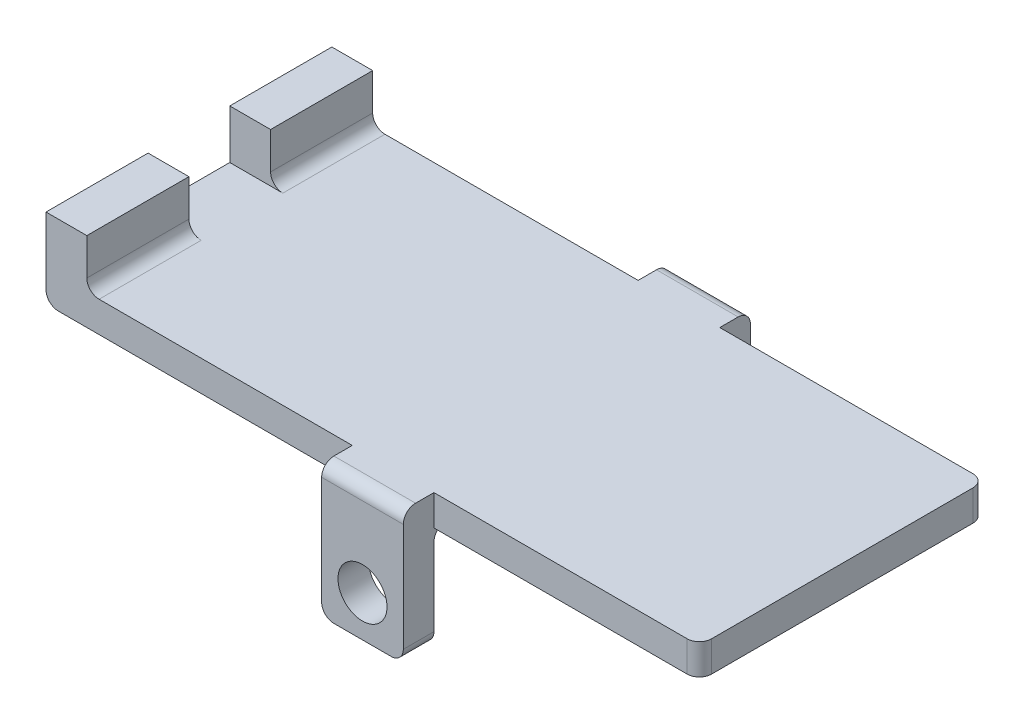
ISO-10303-21;
HEADER;
FILE_DESCRIPTION(('STEP AP214'),'2;1');
FILE_NAME('part.step','',(''),(''),'','','');
FILE_SCHEMA(('AUTOMOTIVE_DESIGN { 1 0 10303 214 1 1 1 1 }'));
ENDSEC;
DATA;
#1=APPLICATION_CONTEXT('core data for automotive mechanical design processes');
#2=APPLICATION_PROTOCOL_DEFINITION('international standard','automotive_design',2000,#1);
#3=PRODUCT_CONTEXT('',#1,'mechanical');
#4=PRODUCT('Part','Part','',(#3));
#5=PRODUCT_RELATED_PRODUCT_CATEGORY('part','',(#4));
#6=PRODUCT_DEFINITION_FORMATION('','',#4);
#7=PRODUCT_DEFINITION_CONTEXT('part definition',#1,'design');
#8=PRODUCT_DEFINITION('design','',#6,#7);
#9=PRODUCT_DEFINITION_SHAPE('','',#8);
#10=(LENGTH_UNIT() NAMED_UNIT(*) SI_UNIT(.MILLI.,.METRE.));
#11=(NAMED_UNIT(*) PLANE_ANGLE_UNIT() SI_UNIT($,.RADIAN.));
#12=(NAMED_UNIT(*) SI_UNIT($,.STERADIAN.) SOLID_ANGLE_UNIT());
#13=UNCERTAINTY_MEASURE_WITH_UNIT(LENGTH_MEASURE(1.E-05),#10,'distance_accuracy_value','');
#14=(GEOMETRIC_REPRESENTATION_CONTEXT(3) GLOBAL_UNCERTAINTY_ASSIGNED_CONTEXT((#13)) GLOBAL_UNIT_ASSIGNED_CONTEXT((#10,
#11,#12)) REPRESENTATION_CONTEXT('',''));
#15=CARTESIAN_POINT('',(0.,0.,0.));
#16=DIRECTION('',(0.,0.,1.));
#17=DIRECTION('',(1.,0.,0.));
#18=AXIS2_PLACEMENT_3D('',#15,#16,#17);
#19=CARTESIAN_POINT('',(-150.,12.,70.));
#20=DIRECTION('',(0.,-1.,0.));
#21=DIRECTION('',(1.,0.,0.));
#22=AXIS2_PLACEMENT_3D('',#19,#20,#21);
#23=PLANE('',#22);
#24=DIRECTION('',(0.,0.,-1.));
#25=VECTOR('',#24,1.);
#26=CARTESIAN_POINT('',(-160.,12.,70.));
#27=LINE('',#26,#25);
#28=CARTESIAN_POINT('',(-160.,12.,25.));
#29=VERTEX_POINT('',#28);
#30=CARTESIAN_POINT('',(-160.,12.,0.));
#31=VERTEX_POINT('',#30);
#32=EDGE_CURVE('E312',#29,#31,#27,.T.);
#33=ORIENTED_EDGE('',*,*,#32,.F.);
#34=DIRECTION('',(-1.,0.,0.));
#35=VECTOR('',#34,1.);
#36=CARTESIAN_POINT('',(-150.,12.,25.));
#37=LINE('',#36,#35);
#38=CARTESIAN_POINT('',(-150.,12.,25.));
#39=VERTEX_POINT('',#38);
#40=EDGE_CURVE('E288',#39,#29,#37,.T.);
#41=ORIENTED_EDGE('',*,*,#40,.F.);
#42=DIRECTION('',(0.,0.,-1.));
#43=VECTOR('',#42,1.);
#44=CARTESIAN_POINT('',(-150.,12.,70.));
#45=LINE('',#44,#43);
#46=CARTESIAN_POINT('',(-150.,12.,0.));
#47=VERTEX_POINT('',#46);
#48=EDGE_CURVE('E296',#39,#47,#45,.T.);
#49=ORIENTED_EDGE('',*,*,#48,.T.);
#50=DIRECTION('',(-1.,0.,0.));
#51=VECTOR('',#50,1.);
#52=CARTESIAN_POINT('',(-150.,12.,0.));
#53=LINE('',#52,#51);
#54=EDGE_CURVE('E526',#47,#31,#53,.T.);
#55=ORIENTED_EDGE('',*,*,#54,.T.);
#56=EDGE_LOOP('',(#33,#41,#49,#55));
#57=FACE_BOUND('',#56,.T.);
#58=ADVANCED_FACE('F39',(#57),#23,.F.);
#59=CARTESIAN_POINT('',(-150.,0.,70.));
#60=DIRECTION('',(-1.,0.,0.));
#61=DIRECTION('',(0.,0.,1.));
#62=AXIS2_PLACEMENT_3D('',#59,#60,#61);
#63=PLANE('',#62);
#64=DIRECTION('',(0.,-1.,0.));
#65=VECTOR('',#64,1.);
#66=CARTESIAN_POINT('',(-150.,12.,25.));
#67=LINE('',#66,#65);
#68=CARTESIAN_POINT('',(-150.,2.99999999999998,25.));
#69=VERTEX_POINT('',#68);
#70=EDGE_CURVE('E277',#39,#69,#67,.T.);
#71=ORIENTED_EDGE('',*,*,#70,.T.);
#72=DIRECTION('',(0.,0.,-1.));
#73=VECTOR('',#72,1.);
#74=CARTESIAN_POINT('',(-150.,2.99999999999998,0.));
#75=LINE('',#74,#73);
#76=CARTESIAN_POINT('',(-150.,2.99999999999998,0.));
#77=VERTEX_POINT('',#76);
#78=EDGE_CURVE('E476',#69,#77,#75,.T.);
#79=ORIENTED_EDGE('',*,*,#78,.T.);
#80=DIRECTION('',(0.,1.,0.));
#81=VECTOR('',#80,1.);
#82=CARTESIAN_POINT('',(-150.,0.,0.));
#83=LINE('',#82,#81);
#84=EDGE_CURVE('E306',#77,#47,#83,.T.);
#85=ORIENTED_EDGE('',*,*,#84,.T.);
#86=ORIENTED_EDGE('',*,*,#48,.F.);
#87=EDGE_LOOP('',(#71,#79,#85,#86));
#88=FACE_BOUND('',#87,.T.);
#89=ADVANCED_FACE('F565',(#88),#63,.F.);
#90=CARTESIAN_POINT('',(-160.,-7.5,70.));
#91=DIRECTION('',(0.,1.,0.));
#92=DIRECTION('',(0.,0.,1.));
#93=AXIS2_PLACEMENT_3D('',#90,#91,#92);
#94=PLANE('',#93);
#95=DIRECTION('',(1.,0.,0.));
#96=VECTOR('',#95,1.);
#97=CARTESIAN_POINT('',(-160.,-7.5,70.));
#98=LINE('',#97,#96);
#99=CARTESIAN_POINT('',(-65.,-7.5,70.));
#100=VERTEX_POINT('',#99);
#101=CARTESIAN_POINT('',(-3.,-7.5,70.));
#102=VERTEX_POINT('',#101);
#103=EDGE_CURVE('E520',#100,#102,#98,.T.);
#104=ORIENTED_EDGE('',*,*,#103,.F.);
#105=DIRECTION('',(0.,0.,-1.));
#106=VECTOR('',#105,1.);
#107=CARTESIAN_POINT('',(-65.,-7.5,77.5));
#108=LINE('',#107,#106);
#109=CARTESIAN_POINT('',(-65.,-7.5,67.));
#110=VERTEX_POINT('',#109);
#111=EDGE_CURVE('E437',#100,#110,#108,.T.);
#112=ORIENTED_EDGE('',*,*,#111,.T.);
#113=DIRECTION('',(1.,0.,0.));
#114=VECTOR('',#113,1.);
#115=CARTESIAN_POINT('',(-85.,-7.5,67.));
#116=LINE('',#115,#114);
#117=CARTESIAN_POINT('',(-85.,-7.5,67.));
#118=VERTEX_POINT('',#117);
#119=EDGE_CURVE('E433',#110,#118,#116,.F.);
#120=ORIENTED_EDGE('',*,*,#119,.T.);
#121=DIRECTION('',(0.,0.,1.));
#122=VECTOR('',#121,1.);
#123=CARTESIAN_POINT('',(-85.,-7.5,77.5));
#124=LINE('',#123,#122);
#125=CARTESIAN_POINT('',(-85.,-7.5,70.));
#126=VERTEX_POINT('',#125);
#127=EDGE_CURVE('E430',#118,#126,#124,.T.);
#128=ORIENTED_EDGE('',*,*,#127,.T.);
#129=CARTESIAN_POINT('',(-157.,-7.5,70.));
#130=VERTEX_POINT('',#129);
#131=EDGE_CURVE('E515',#130,#126,#98,.T.);
#132=ORIENTED_EDGE('',*,*,#131,.F.);
#133=DIRECTION('',(0.,0.,-1.));
#134=VECTOR('',#133,1.);
#135=CARTESIAN_POINT('',(-157.,-7.5,70.));
#136=LINE('',#135,#134);
#137=CARTESIAN_POINT('',(-157.,-7.5,0.));
#138=VERTEX_POINT('',#137);
#139=EDGE_CURVE('E323',#130,#138,#136,.T.);
#140=ORIENTED_EDGE('',*,*,#139,.T.);
#141=DIRECTION('',(1.,0.,0.));
#142=VECTOR('',#141,1.);
#143=CARTESIAN_POINT('',(-160.,-7.5,0.));
#144=LINE('',#143,#142);
#145=CARTESIAN_POINT('',(-85.,-7.5,0.));
#146=VERTEX_POINT('',#145);
#147=EDGE_CURVE('E536',#138,#146,#144,.T.);
#148=ORIENTED_EDGE('',*,*,#147,.T.);
#149=DIRECTION('',(0.,0.,1.));
#150=VECTOR('',#149,1.);
#151=CARTESIAN_POINT('',(-85.,-7.5,70.));
#152=LINE('',#151,#150);
#153=CARTESIAN_POINT('',(-85.,-7.5,3.));
#154=VERTEX_POINT('',#153);
#155=EDGE_CURVE('E419',#146,#154,#152,.T.);
#156=ORIENTED_EDGE('',*,*,#155,.T.);
#157=DIRECTION('',(1.,0.,0.));
#158=VECTOR('',#157,1.);
#159=CARTESIAN_POINT('',(-160.,-7.5,3.));
#160=LINE('',#159,#158);
#161=CARTESIAN_POINT('',(-65.,-7.5,3.));
#162=VERTEX_POINT('',#161);
#163=EDGE_CURVE('E423',#154,#162,#160,.T.);
#164=ORIENTED_EDGE('',*,*,#163,.T.);
#165=DIRECTION('',(0.,0.,-1.));
#166=VECTOR('',#165,1.);
#167=CARTESIAN_POINT('',(-65.,-7.5,70.));
#168=LINE('',#167,#166);
#169=CARTESIAN_POINT('',(-65.,-7.5,0.));
#170=VERTEX_POINT('',#169);
#171=EDGE_CURVE('E427',#162,#170,#168,.T.);
#172=ORIENTED_EDGE('',*,*,#171,.T.);
#173=CARTESIAN_POINT('',(-3.,-7.5,0.));
#174=VERTEX_POINT('',#173);
#175=EDGE_CURVE('E535',#170,#174,#144,.T.);
#176=ORIENTED_EDGE('',*,*,#175,.T.);
#177=CARTESIAN_POINT('',(-3.,-7.5,3.));
#178=DIRECTION('',(0.,1.,0.));
#179=DIRECTION('',(0.,0.,1.));
#180=AXIS2_PLACEMENT_3D('',#177,#178,#179);
#181=CIRCLE('',#180,3.);
#182=CARTESIAN_POINT('',(0.,-7.5,3.));
#183=VERTEX_POINT('',#182);
#184=EDGE_CURVE('E320',#174,#183,#181,.F.);
#185=ORIENTED_EDGE('',*,*,#184,.T.);
#186=DIRECTION('',(0.,0.,-1.));
#187=VECTOR('',#186,1.);
#188=CARTESIAN_POINT('',(0.,-7.5,70.));
#189=LINE('',#188,#187);
#190=CARTESIAN_POINT('',(0.,-7.5,67.));
#191=VERTEX_POINT('',#190);
#192=EDGE_CURVE('E301',#191,#183,#189,.T.);
#193=ORIENTED_EDGE('',*,*,#192,.F.);
#194=CARTESIAN_POINT('',(-3.,-7.5,67.));
#195=DIRECTION('',(0.,1.,0.));
#196=DIRECTION('',(0.,0.,1.));
#197=AXIS2_PLACEMENT_3D('',#194,#195,#196);
#198=CIRCLE('',#197,3.);
#199=EDGE_CURVE('E316',#191,#102,#198,.F.);
#200=ORIENTED_EDGE('',*,*,#199,.T.);
#201=EDGE_LOOP('',(#104,#112,#120,#128,#132,#140,#148,#156,#164,#172,#176,#185,#193,#200));
#202=FACE_BOUND('',#201,.T.);
#203=ADVANCED_FACE('F680',(#202),#94,.F.);
#204=CARTESIAN_POINT('',(0.,0.,0.));
#205=DIRECTION('',(0.,0.,1.));
#206=DIRECTION('',(1.,0.,0.));
#207=AXIS2_PLACEMENT_3D('',#204,#205,#206);
#208=PLANE('',#207);
#209=DIRECTION('',(-1.,0.,0.));
#210=VECTOR('',#209,1.);
#211=CARTESIAN_POINT('',(0.,0.,0.));
#212=LINE('',#211,#210);
#213=CARTESIAN_POINT('',(-85.,0.,0.));
#214=VERTEX_POINT('',#213);
#215=CARTESIAN_POINT('',(-147.,0.,0.));
#216=VERTEX_POINT('',#215);
#217=EDGE_CURVE('E539',#214,#216,#212,.T.);
#218=ORIENTED_EDGE('',*,*,#217,.F.);
#219=DIRECTION('',(0.,-1.,0.));
#220=VECTOR('',#219,1.);
#221=CARTESIAN_POINT('',(-85.,0.,0.));
#222=LINE('',#221,#220);
#223=EDGE_CURVE('E626',#214,#146,#222,.T.);
#224=ORIENTED_EDGE('',*,*,#223,.T.);
#225=ORIENTED_EDGE('',*,*,#147,.F.);
#226=CARTESIAN_POINT('',(-157.,-4.5,0.));
#227=DIRECTION('',(0.,0.,1.));
#228=DIRECTION('',(1.,0.,0.));
#229=AXIS2_PLACEMENT_3D('',#226,#227,#228);
#230=CIRCLE('',#229,3.);
#231=CARTESIAN_POINT('',(-160.,-4.5,0.));
#232=VERTEX_POINT('',#231);
#233=EDGE_CURVE('E331',#138,#232,#230,.F.);
#234=ORIENTED_EDGE('',*,*,#233,.T.);
#235=DIRECTION('',(0.,-1.,0.));
#236=VECTOR('',#235,1.);
#237=CARTESIAN_POINT('',(-160.,12.,0.));
#238=LINE('',#237,#236);
#239=EDGE_CURVE('E530',#31,#232,#238,.T.);
#240=ORIENTED_EDGE('',*,*,#239,.F.);
#241=ORIENTED_EDGE('',*,*,#54,.F.);
#242=ORIENTED_EDGE('',*,*,#84,.F.);
#243=CARTESIAN_POINT('',(-147.,2.99999999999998,0.));
#244=DIRECTION('',(0.,0.,1.));
#245=DIRECTION('',(1.,0.,0.));
#246=AXIS2_PLACEMENT_3D('',#243,#244,#245);
#247=CIRCLE('',#246,3.);
#248=EDGE_CURVE('E495',#77,#216,#247,.T.);
#249=ORIENTED_EDGE('',*,*,#248,.T.);
#250=EDGE_LOOP('',(#218,#224,#225,#234,#240,#241,#242,#249));
#251=FACE_BOUND('',#250,.T.);
#252=ADVANCED_FACE('F729',(#251),#208,.F.);
#253=CARTESIAN_POINT('',(0.,0.,70.));
#254=DIRECTION('',(0.,0.,1.));
#255=DIRECTION('',(1.,0.,0.));
#256=AXIS2_PLACEMENT_3D('',#253,#254,#255);
#257=PLANE('',#256);
#258=ORIENTED_EDGE('',*,*,#131,.T.);
#259=DIRECTION('',(0.,-1.,0.));
#260=VECTOR('',#259,1.);
#261=CARTESIAN_POINT('',(-85.,0.,70.));
#262=LINE('',#261,#260);
#263=CARTESIAN_POINT('',(-85.,0.,70.));
#264=VERTEX_POINT('',#263);
#265=EDGE_CURVE('E512',#264,#126,#262,.T.);
#266=ORIENTED_EDGE('',*,*,#265,.F.);
#267=DIRECTION('',(-1.,0.,0.));
#268=VECTOR('',#267,1.);
#269=CARTESIAN_POINT('',(0.,0.,70.));
#270=LINE('',#269,#268);
#271=CARTESIAN_POINT('',(-147.,0.,70.));
#272=VERTEX_POINT('',#271);
#273=EDGE_CURVE('E507',#264,#272,#270,.T.);
#274=ORIENTED_EDGE('',*,*,#273,.T.);
#275=CARTESIAN_POINT('',(-147.,2.99999999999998,70.));
#276=DIRECTION('',(0.,0.,1.));
#277=DIRECTION('',(1.,0.,0.));
#278=AXIS2_PLACEMENT_3D('',#275,#276,#277);
#279=CIRCLE('',#278,3.);
#280=CARTESIAN_POINT('',(-150.,2.99999999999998,70.));
#281=VERTEX_POINT('',#280);
#282=EDGE_CURVE('E11',#272,#281,#279,.F.);
#283=ORIENTED_EDGE('',*,*,#282,.T.);
#284=DIRECTION('',(0.,1.,0.));
#285=VECTOR('',#284,1.);
#286=CARTESIAN_POINT('',(-150.,0.,70.));
#287=LINE('',#286,#285);
#288=CARTESIAN_POINT('',(-150.,12.,70.));
#289=VERTEX_POINT('',#288);
#290=EDGE_CURVE('E304',#281,#289,#287,.T.);
#291=ORIENTED_EDGE('',*,*,#290,.T.);
#292=DIRECTION('',(-1.,0.,0.));
#293=VECTOR('',#292,1.);
#294=CARTESIAN_POINT('',(-150.,12.,70.));
#295=LINE('',#294,#293);
#296=CARTESIAN_POINT('',(-160.,12.,70.));
#297=VERTEX_POINT('',#296);
#298=EDGE_CURVE('E293',#289,#297,#295,.T.);
#299=ORIENTED_EDGE('',*,*,#298,.T.);
#300=DIRECTION('',(0.,-1.,0.));
#301=VECTOR('',#300,1.);
#302=CARTESIAN_POINT('',(-160.,12.,70.));
#303=LINE('',#302,#301);
#304=CARTESIAN_POINT('',(-160.,-4.5,70.));
#305=VERTEX_POINT('',#304);
#306=EDGE_CURVE('E666',#297,#305,#303,.T.);
#307=ORIENTED_EDGE('',*,*,#306,.T.);
#308=CARTESIAN_POINT('',(-157.,-4.5,70.));
#309=DIRECTION('',(0.,0.,1.));
#310=DIRECTION('',(1.,0.,0.));
#311=AXIS2_PLACEMENT_3D('',#308,#309,#310);
#312=CIRCLE('',#311,3.);
#313=EDGE_CURVE('E341',#305,#130,#312,.T.);
#314=ORIENTED_EDGE('',*,*,#313,.T.);
#315=EDGE_LOOP('',(#258,#266,#274,#283,#291,#299,#307,#314));
#316=FACE_BOUND('',#315,.T.);
#317=ADVANCED_FACE('F510',(#316),#257,.T.);
#318=CARTESIAN_POINT('',(-3.,0.,70.));
#319=VERTEX_POINT('',#318);
#320=CARTESIAN_POINT('',(-65.,0.,70.));
#321=VERTEX_POINT('',#320);
#322=EDGE_CURVE('E514',#319,#321,#270,.T.);
#323=ORIENTED_EDGE('',*,*,#322,.T.);
#324=DIRECTION('',(0.,1.,0.));
#325=VECTOR('',#324,1.);
#326=CARTESIAN_POINT('',(-65.,0.,70.));
#327=LINE('',#326,#325);
#328=EDGE_CURVE('E651',#100,#321,#327,.T.);
#329=ORIENTED_EDGE('',*,*,#328,.F.);
#330=ORIENTED_EDGE('',*,*,#103,.T.);
#331=DIRECTION('',(0.,1.,0.));
#332=VECTOR('',#331,1.);
#333=CARTESIAN_POINT('',(-3.,0.,70.));
#334=LINE('',#333,#332);
#335=EDGE_CURVE('E337',#102,#319,#334,.T.);
#336=ORIENTED_EDGE('',*,*,#335,.T.);
#337=EDGE_LOOP('',(#323,#329,#330,#336));
#338=FACE_BOUND('',#337,.T.);
#339=ADVANCED_FACE('F674',(#338),#257,.T.);
#340=CARTESIAN_POINT('',(-150.,12.,45.));
#341=VERTEX_POINT('',#340);
#342=EDGE_CURVE('E271',#289,#341,#45,.T.);
#343=ORIENTED_EDGE('',*,*,#342,.T.);
#344=DIRECTION('',(-1.,0.,0.));
#345=VECTOR('',#344,1.);
#346=CARTESIAN_POINT('',(-150.,12.,45.));
#347=LINE('',#346,#345);
#348=CARTESIAN_POINT('',(-160.,12.,45.));
#349=VERTEX_POINT('',#348);
#350=EDGE_CURVE('E280',#341,#349,#347,.T.);
#351=ORIENTED_EDGE('',*,*,#350,.T.);
#352=EDGE_CURVE('E313',#297,#349,#27,.T.);
#353=ORIENTED_EDGE('',*,*,#352,.F.);
#354=ORIENTED_EDGE('',*,*,#298,.F.);
#355=EDGE_LOOP('',(#343,#351,#353,#354));
#356=FACE_BOUND('',#355,.T.);
#357=ADVANCED_FACE('F291',(#356),#23,.F.);
#358=CARTESIAN_POINT('',(-160.,12.,70.));
#359=DIRECTION('',(1.,0.,0.));
#360=DIRECTION('',(0.,0.,-1.));
#361=AXIS2_PLACEMENT_3D('',#358,#359,#360);
#362=PLANE('',#361);
#363=DIRECTION('',(0.,0.,1.));
#364=VECTOR('',#363,1.);
#365=CARTESIAN_POINT('',(-160.,0.,25.));
#366=LINE('',#365,#364);
#367=CARTESIAN_POINT('',(-160.,0.,25.));
#368=VERTEX_POINT('',#367);
#369=CARTESIAN_POINT('',(-160.,0.,45.));
#370=VERTEX_POINT('',#369);
#371=EDGE_CURVE('E570',#368,#370,#366,.T.);
#372=ORIENTED_EDGE('',*,*,#371,.F.);
#373=DIRECTION('',(0.,-1.,0.));
#374=VECTOR('',#373,1.);
#375=CARTESIAN_POINT('',(-160.,12.,25.));
#376=LINE('',#375,#374);
#377=EDGE_CURVE('E573',#29,#368,#376,.T.);
#378=ORIENTED_EDGE('',*,*,#377,.F.);
#379=ORIENTED_EDGE('',*,*,#32,.T.);
#380=ORIENTED_EDGE('',*,*,#239,.T.);
#381=DIRECTION('',(0.,0.,-1.));
#382=VECTOR('',#381,1.);
#383=CARTESIAN_POINT('',(-160.,-4.5,70.));
#384=LINE('',#383,#382);
#385=EDGE_CURVE('E334',#232,#305,#384,.F.);
#386=ORIENTED_EDGE('',*,*,#385,.T.);
#387=ORIENTED_EDGE('',*,*,#306,.F.);
#388=ORIENTED_EDGE('',*,*,#352,.T.);
#389=DIRECTION('',(0.,1.,0.));
#390=VECTOR('',#389,1.);
#391=CARTESIAN_POINT('',(-160.,12.,45.));
#392=LINE('',#391,#390);
#393=EDGE_CURVE('E283',#370,#349,#392,.T.);
#394=ORIENTED_EDGE('',*,*,#393,.F.);
#395=EDGE_LOOP('',(#372,#378,#379,#380,#386,#387,#388,#394));
#396=FACE_BOUND('',#395,.T.);
#397=ADVANCED_FACE('F751',(#396),#362,.F.);
#398=CARTESIAN_POINT('',(0.,-7.5,70.));
#399=DIRECTION('',(-1.,0.,0.));
#400=DIRECTION('',(0.,0.,1.));
#401=AXIS2_PLACEMENT_3D('',#398,#399,#400);
#402=PLANE('',#401);
#403=ORIENTED_EDGE('',*,*,#192,.T.);
#404=DIRECTION('',(0.,1.,0.));
#405=VECTOR('',#404,1.);
#406=CARTESIAN_POINT('',(0.,-7.5,3.));
#407=LINE('',#406,#405);
#408=CARTESIAN_POINT('',(0.,0.,3.));
#409=VERTEX_POINT('',#408);
#410=EDGE_CURVE('E347',#183,#409,#407,.T.);
#411=ORIENTED_EDGE('',*,*,#410,.T.);
#412=DIRECTION('',(0.,0.,-1.));
#413=VECTOR('',#412,1.);
#414=CARTESIAN_POINT('',(0.,0.,70.));
#415=LINE('',#414,#413);
#416=CARTESIAN_POINT('',(0.,0.,67.));
#417=VERTEX_POINT('',#416);
#418=EDGE_CURVE('E295',#417,#409,#415,.T.);
#419=ORIENTED_EDGE('',*,*,#418,.F.);
#420=DIRECTION('',(0.,1.,0.));
#421=VECTOR('',#420,1.);
#422=CARTESIAN_POINT('',(0.,-7.5,67.));
#423=LINE('',#422,#421);
#424=EDGE_CURVE('E344',#417,#191,#423,.F.);
#425=ORIENTED_EDGE('',*,*,#424,.T.);
#426=EDGE_LOOP('',(#403,#411,#419,#425));
#427=FACE_BOUND('',#426,.T.);
#428=ADVANCED_FACE('F686',(#427),#402,.F.);
#429=CARTESIAN_POINT('',(0.,0.,70.));
#430=DIRECTION('',(0.,-1.,0.));
#431=DIRECTION('',(1.,0.,0.));
#432=AXIS2_PLACEMENT_3D('',#429,#430,#431);
#433=PLANE('',#432);
#434=ORIENTED_EDGE('',*,*,#217,.T.);
#435=DIRECTION('',(0.,0.,-1.));
#436=VECTOR('',#435,1.);
#437=CARTESIAN_POINT('',(-147.,0.,25.));
#438=LINE('',#437,#436);
#439=CARTESIAN_POINT('',(-147.,0.,25.));
#440=VERTEX_POINT('',#439);
#441=EDGE_CURVE('E489',#216,#440,#438,.F.);
#442=ORIENTED_EDGE('',*,*,#441,.T.);
#443=DIRECTION('',(-1.,0.,0.));
#444=VECTOR('',#443,1.);
#445=CARTESIAN_POINT('',(-150.,0.,25.));
#446=LINE('',#445,#444);
#447=EDGE_CURVE('E276',#440,#368,#446,.T.);
#448=ORIENTED_EDGE('',*,*,#447,.T.);
#449=ORIENTED_EDGE('',*,*,#371,.T.);
#450=DIRECTION('',(-1.,0.,0.));
#451=VECTOR('',#450,1.);
#452=CARTESIAN_POINT('',(-150.,0.,45.));
#453=LINE('',#452,#451);
#454=CARTESIAN_POINT('',(-147.,0.,45.));
#455=VERTEX_POINT('',#454);
#456=EDGE_CURVE('E289',#455,#370,#453,.T.);
#457=ORIENTED_EDGE('',*,*,#456,.F.);
#458=DIRECTION('',(0.,0.,-1.));
#459=VECTOR('',#458,1.);
#460=CARTESIAN_POINT('',(-147.,0.,70.));
#461=LINE('',#460,#459);
#462=EDGE_CURVE('E486',#455,#272,#461,.F.);
#463=ORIENTED_EDGE('',*,*,#462,.T.);
#464=ORIENTED_EDGE('',*,*,#273,.F.);
#465=DIRECTION('',(0.,0.,-1.));
#466=VECTOR('',#465,1.);
#467=CARTESIAN_POINT('',(-85.,0.,77.5));
#468=LINE('',#467,#466);
#469=CARTESIAN_POINT('',(-85.,0.,74.5));
#470=VERTEX_POINT('',#469);
#471=EDGE_CURVE('E655',#470,#264,#468,.T.);
#472=ORIENTED_EDGE('',*,*,#471,.F.);
#473=DIRECTION('',(-1.,0.,0.));
#474=VECTOR('',#473,1.);
#475=CARTESIAN_POINT('',(-65.,0.,74.5));
#476=LINE('',#475,#474);
#477=CARTESIAN_POINT('',(-65.,0.,74.5));
#478=VERTEX_POINT('',#477);
#479=EDGE_CURVE('E377',#470,#478,#476,.F.);
#480=ORIENTED_EDGE('',*,*,#479,.T.);
#481=DIRECTION('',(0.,0.,-1.));
#482=VECTOR('',#481,1.);
#483=CARTESIAN_POINT('',(-65.,0.,77.5));
#484=LINE('',#483,#482);
#485=EDGE_CURVE('E531',#478,#321,#484,.T.);
#486=ORIENTED_EDGE('',*,*,#485,.T.);
#487=ORIENTED_EDGE('',*,*,#322,.F.);
#488=CARTESIAN_POINT('',(-3.,0.,67.));
#489=DIRECTION('',(0.,-1.,0.));
#490=DIRECTION('',(1.,0.,0.));
#491=AXIS2_PLACEMENT_3D('',#488,#489,#490);
#492=CIRCLE('',#491,3.);
#493=EDGE_CURVE('E351',#319,#417,#492,.F.);
#494=ORIENTED_EDGE('',*,*,#493,.T.);
#495=ORIENTED_EDGE('',*,*,#418,.T.);
#496=CARTESIAN_POINT('',(-3.,0.,3.));
#497=DIRECTION('',(0.,-1.,0.));
#498=DIRECTION('',(1.,0.,0.));
#499=AXIS2_PLACEMENT_3D('',#496,#497,#498);
#500=CIRCLE('',#499,3.);
#501=CARTESIAN_POINT('',(-3.,0.,0.));
#502=VERTEX_POINT('',#501);
#503=EDGE_CURVE('E354',#409,#502,#500,.F.);
#504=ORIENTED_EDGE('',*,*,#503,.T.);
#505=CARTESIAN_POINT('',(-65.,0.,0.));
#506=VERTEX_POINT('',#505);
#507=EDGE_CURVE('E540',#502,#506,#212,.T.);
#508=ORIENTED_EDGE('',*,*,#507,.T.);
#509=DIRECTION('',(0.,0.,1.));
#510=VECTOR('',#509,1.);
#511=CARTESIAN_POINT('',(-65.,0.,-7.5));
#512=LINE('',#511,#510);
#513=CARTESIAN_POINT('',(-65.,0.,-4.5));
#514=VERTEX_POINT('',#513);
#515=EDGE_CURVE('E636',#514,#506,#512,.T.);
#516=ORIENTED_EDGE('',*,*,#515,.F.);
#517=DIRECTION('',(-1.,0.,0.));
#518=VECTOR('',#517,1.);
#519=CARTESIAN_POINT('',(-85.,0.,-4.5));
#520=LINE('',#519,#518);
#521=CARTESIAN_POINT('',(-85.,0.,-4.5));
#522=VERTEX_POINT('',#521);
#523=EDGE_CURVE('E373',#514,#522,#520,.T.);
#524=ORIENTED_EDGE('',*,*,#523,.T.);
#525=DIRECTION('',(0.,0.,1.));
#526=VECTOR('',#525,1.);
#527=CARTESIAN_POINT('',(-85.,0.,-7.5));
#528=LINE('',#527,#526);
#529=EDGE_CURVE('E551',#522,#214,#528,.T.);
#530=ORIENTED_EDGE('',*,*,#529,.T.);
#531=EDGE_LOOP('',(#434,#442,#448,#449,#457,#463,#464,#472,#480,#486,#487,#494,#495,#504,#508,
#516,#524,#530));
#532=FACE_BOUND('',#531,.T.);
#533=ADVANCED_FACE('F505',(#532),#433,.F.);
#534=ORIENTED_EDGE('',*,*,#290,.F.);
#535=DIRECTION('',(0.,0.,-1.));
#536=VECTOR('',#535,1.);
#537=CARTESIAN_POINT('',(-150.,2.99999999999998,45.));
#538=LINE('',#537,#536);
#539=CARTESIAN_POINT('',(-150.,2.99999999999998,45.));
#540=VERTEX_POINT('',#539);
#541=EDGE_CURVE('E273',#281,#540,#538,.T.);
#542=ORIENTED_EDGE('',*,*,#541,.T.);
#543=DIRECTION('',(0.,1.,0.));
#544=VECTOR('',#543,1.);
#545=CARTESIAN_POINT('',(-150.,12.,45.));
#546=LINE('',#545,#544);
#547=EDGE_CURVE('E267',#540,#341,#546,.T.);
#548=ORIENTED_EDGE('',*,*,#547,.T.);
#549=ORIENTED_EDGE('',*,*,#342,.F.);
#550=EDGE_LOOP('',(#534,#542,#548,#549));
#551=FACE_BOUND('',#550,.T.);
#552=ADVANCED_FACE('F269',(#551),#63,.F.);
#553=ORIENTED_EDGE('',*,*,#175,.F.);
#554=DIRECTION('',(0.,1.,0.));
#555=VECTOR('',#554,1.);
#556=CARTESIAN_POINT('',(-65.,0.,0.));
#557=LINE('',#556,#555);
#558=EDGE_CURVE('E632',#170,#506,#557,.T.);
#559=ORIENTED_EDGE('',*,*,#558,.T.);
#560=ORIENTED_EDGE('',*,*,#507,.F.);
#561=DIRECTION('',(0.,1.,0.));
#562=VECTOR('',#561,1.);
#563=CARTESIAN_POINT('',(-3.,0.,0.));
#564=LINE('',#563,#562);
#565=EDGE_CURVE('E327',#502,#174,#564,.F.);
#566=ORIENTED_EDGE('',*,*,#565,.T.);
#567=EDGE_LOOP('',(#553,#559,#560,#566));
#568=FACE_BOUND('',#567,.T.);
#569=ADVANCED_FACE('F694',(#568),#208,.F.);
#570=CARTESIAN_POINT('',(-157.,-4.5,70.));
#571=DIRECTION('',(0.,0.,-1.));
#572=DIRECTION('',(-1.,0.,0.));
#573=AXIS2_PLACEMENT_3D('',#570,#571,#572);
#574=CYLINDRICAL_SURFACE('',#573,3.);
#575=ORIENTED_EDGE('',*,*,#313,.F.);
#576=ORIENTED_EDGE('',*,*,#385,.F.);
#577=ORIENTED_EDGE('',*,*,#233,.F.);
#578=ORIENTED_EDGE('',*,*,#139,.F.);
#579=EDGE_LOOP('',(#575,#576,#577,#578));
#580=FACE_BOUND('',#579,.T.);
#581=ADVANCED_FACE('F740',(#580),#574,.T.);
#582=CARTESIAN_POINT('',(-3.,-7.5,3.));
#583=DIRECTION('',(0.,1.,0.));
#584=DIRECTION('',(0.,0.,1.));
#585=AXIS2_PLACEMENT_3D('',#582,#583,#584);
#586=CYLINDRICAL_SURFACE('',#585,3.);
#587=ORIENTED_EDGE('',*,*,#184,.F.);
#588=ORIENTED_EDGE('',*,*,#565,.F.);
#589=ORIENTED_EDGE('',*,*,#503,.F.);
#590=ORIENTED_EDGE('',*,*,#410,.F.);
#591=EDGE_LOOP('',(#587,#588,#589,#590));
#592=FACE_BOUND('',#591,.T.);
#593=ADVANCED_FACE('F690',(#592),#586,.T.);
#594=CARTESIAN_POINT('',(-3.,0.,67.));
#595=DIRECTION('',(0.,-1.,0.));
#596=DIRECTION('',(0.,0.,-1.));
#597=AXIS2_PLACEMENT_3D('',#594,#595,#596);
#598=CYLINDRICAL_SURFACE('',#597,3.);
#599=ORIENTED_EDGE('',*,*,#199,.F.);
#600=ORIENTED_EDGE('',*,*,#424,.F.);
#601=ORIENTED_EDGE('',*,*,#493,.F.);
#602=ORIENTED_EDGE('',*,*,#335,.F.);
#603=EDGE_LOOP('',(#599,#600,#601,#602));
#604=FACE_BOUND('',#603,.T.);
#605=ADVANCED_FACE('F683',(#604),#598,.T.);
#606=CARTESIAN_POINT('',(-85.,0.,77.5));
#607=DIRECTION('',(1.,0.,0.));
#608=DIRECTION('',(0.,0.,-1.));
#609=AXIS2_PLACEMENT_3D('',#606,#607,#608);
#610=PLANE('',#609);
#611=DIRECTION('',(0.,-1.,0.));
#612=VECTOR('',#611,1.);
#613=CARTESIAN_POINT('',(-85.,0.,77.5));
#614=LINE('',#613,#612);
#615=CARTESIAN_POINT('',(-85.,-3.00000000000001,77.5));
#616=VERTEX_POINT('',#615);
#617=CARTESIAN_POINT('',(-85.,-29.5,77.5));
#618=VERTEX_POINT('',#617);
#619=EDGE_CURVE('E646',#616,#618,#614,.T.);
#620=ORIENTED_EDGE('',*,*,#619,.F.);
#621=CARTESIAN_POINT('',(-85.,-3.00000000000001,74.5));
#622=DIRECTION('',(1.,0.,0.));
#623=DIRECTION('',(0.,0.,-1.));
#624=AXIS2_PLACEMENT_3D('',#621,#622,#623);
#625=CIRCLE('',#624,3.);
#626=EDGE_CURVE('E370',#616,#470,#625,.F.);
#627=ORIENTED_EDGE('',*,*,#626,.T.);
#628=ORIENTED_EDGE('',*,*,#471,.T.);
#629=ORIENTED_EDGE('',*,*,#265,.T.);
#630=ORIENTED_EDGE('',*,*,#127,.F.);
#631=CARTESIAN_POINT('',(-85.,-10.5,67.));
#632=DIRECTION('',(1.,0.,0.));
#633=DIRECTION('',(0.,0.,-1.));
#634=AXIS2_PLACEMENT_3D('',#631,#632,#633);
#635=CIRCLE('',#634,3.);
#636=CARTESIAN_POINT('',(-85.,-10.5,70.));
#637=VERTEX_POINT('',#636);
#638=EDGE_CURVE('E467',#118,#637,#635,.T.);
#639=ORIENTED_EDGE('',*,*,#638,.T.);
#640=DIRECTION('',(0.,1.,0.));
#641=VECTOR('',#640,1.);
#642=CARTESIAN_POINT('',(-85.,-32.5,70.));
#643=LINE('',#642,#641);
#644=CARTESIAN_POINT('',(-85.,-29.5,70.));
#645=VERTEX_POINT('',#644);
#646=EDGE_CURVE('E622',#645,#637,#643,.T.);
#647=ORIENTED_EDGE('',*,*,#646,.F.);
#648=DIRECTION('',(0.,0.,-1.));
#649=VECTOR('',#648,1.);
#650=CARTESIAN_POINT('',(-85.,-29.5,77.5));
#651=LINE('',#650,#649);
#652=EDGE_CURVE('E367',#645,#618,#651,.F.);
#653=ORIENTED_EDGE('',*,*,#652,.T.);
#654=EDGE_LOOP('',(#620,#627,#628,#629,#630,#639,#647,#653));
#655=FACE_BOUND('',#654,.T.);
#656=ADVANCED_FACE('F760',(#655),#610,.F.);
#657=CARTESIAN_POINT('',(-65.,0.,77.5));
#658=DIRECTION('',(-1.,0.,0.));
#659=DIRECTION('',(0.,0.,1.));
#660=AXIS2_PLACEMENT_3D('',#657,#658,#659);
#661=PLANE('',#660);
#662=ORIENTED_EDGE('',*,*,#485,.F.);
#663=CARTESIAN_POINT('',(-65.,-3.00000000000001,74.5));
#664=DIRECTION('',(-1.,0.,0.));
#665=DIRECTION('',(0.,0.,1.));
#666=AXIS2_PLACEMENT_3D('',#663,#664,#665);
#667=CIRCLE('',#666,3.);
#668=CARTESIAN_POINT('',(-65.,-3.00000000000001,77.5));
#669=VERTEX_POINT('',#668);
#670=EDGE_CURVE('E383',#478,#669,#667,.F.);
#671=ORIENTED_EDGE('',*,*,#670,.T.);
#672=DIRECTION('',(0.,1.,0.));
#673=VECTOR('',#672,1.);
#674=CARTESIAN_POINT('',(-65.,0.,77.5));
#675=LINE('',#674,#673);
#676=CARTESIAN_POINT('',(-65.,-29.5,77.5));
#677=VERTEX_POINT('',#676);
#678=EDGE_CURVE('E650',#677,#669,#675,.T.);
#679=ORIENTED_EDGE('',*,*,#678,.F.);
#680=DIRECTION('',(0.,0.,1.));
#681=VECTOR('',#680,1.);
#682=CARTESIAN_POINT('',(-65.,-29.5,70.));
#683=LINE('',#682,#681);
#684=CARTESIAN_POINT('',(-65.,-29.5,70.));
#685=VERTEX_POINT('',#684);
#686=EDGE_CURVE('E380',#677,#685,#683,.F.);
#687=ORIENTED_EDGE('',*,*,#686,.T.);
#688=DIRECTION('',(0.,1.,0.));
#689=VECTOR('',#688,1.);
#690=CARTESIAN_POINT('',(-65.,-32.5,70.));
#691=LINE('',#690,#689);
#692=CARTESIAN_POINT('',(-65.,-10.5,70.));
#693=VERTEX_POINT('',#692);
#694=EDGE_CURVE('E618',#685,#693,#691,.T.);
#695=ORIENTED_EDGE('',*,*,#694,.T.);
#696=CARTESIAN_POINT('',(-65.,-10.5,67.));
#697=DIRECTION('',(-1.,0.,0.));
#698=DIRECTION('',(0.,0.,1.));
#699=AXIS2_PLACEMENT_3D('',#696,#697,#698);
#700=CIRCLE('',#699,3.);
#701=EDGE_CURVE('E464',#693,#110,#700,.T.);
#702=ORIENTED_EDGE('',*,*,#701,.T.);
#703=ORIENTED_EDGE('',*,*,#111,.F.);
#704=ORIENTED_EDGE('',*,*,#328,.T.);
#705=EDGE_LOOP('',(#662,#671,#679,#687,#695,#702,#703,#704));
#706=FACE_BOUND('',#705,.T.);
#707=ADVANCED_FACE('F763',(#706),#661,.F.);
#708=CARTESIAN_POINT('',(0.,0.,77.5));
#709=DIRECTION('',(0.,0.,1.));
#710=DIRECTION('',(1.,0.,0.));
#711=AXIS2_PLACEMENT_3D('',#708,#709,#710);
#712=PLANE('',#711);
#713=CARTESIAN_POINT('',(-75.,-22.5,77.5));
#714=DIRECTION('',(0.,0.,1.));
#715=DIRECTION('',(1.,0.,0.));
#716=AXIS2_PLACEMENT_3D('',#713,#714,#715);
#717=CIRCLE('',#716,6.);
#718=CARTESIAN_POINT('',(-69.,-22.5,77.5));
#719=VERTEX_POINT('',#718);
#720=EDGE_CURVE('E579',#719,#719,#717,.T.);
#721=ORIENTED_EDGE('',*,*,#720,.F.);
#722=EDGE_LOOP('',(#721));
#723=FACE_BOUND('',#722,.T.);
#724=ORIENTED_EDGE('',*,*,#678,.T.);
#725=DIRECTION('',(-1.,0.,0.));
#726=VECTOR('',#725,1.);
#727=CARTESIAN_POINT('',(-85.,-3.00000000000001,77.5));
#728=LINE('',#727,#726);
#729=EDGE_CURVE('E363',#669,#616,#728,.T.);
#730=ORIENTED_EDGE('',*,*,#729,.T.);
#731=ORIENTED_EDGE('',*,*,#619,.T.);
#732=CARTESIAN_POINT('',(-82.,-29.5,77.5));
#733=DIRECTION('',(0.,0.,1.));
#734=DIRECTION('',(1.,0.,0.));
#735=AXIS2_PLACEMENT_3D('',#732,#733,#734);
#736=CIRCLE('',#735,3.);
#737=CARTESIAN_POINT('',(-82.,-32.5,77.5));
#738=VERTEX_POINT('',#737);
#739=EDGE_CURVE('E360',#618,#738,#736,.T.);
#740=ORIENTED_EDGE('',*,*,#739,.T.);
#741=DIRECTION('',(-1.,0.,0.));
#742=VECTOR('',#741,1.);
#743=CARTESIAN_POINT('',(-85.,-32.5,77.5));
#744=LINE('',#743,#742);
#745=CARTESIAN_POINT('',(-68.,-32.5,77.5));
#746=VERTEX_POINT('',#745);
#747=EDGE_CURVE('E614',#746,#738,#744,.T.);
#748=ORIENTED_EDGE('',*,*,#747,.F.);
#749=CARTESIAN_POINT('',(-68.,-29.5,77.5));
#750=DIRECTION('',(0.,0.,1.));
#751=DIRECTION('',(1.,0.,0.));
#752=AXIS2_PLACEMENT_3D('',#749,#750,#751);
#753=CIRCLE('',#752,3.);
#754=EDGE_CURVE('E357',#746,#677,#753,.T.);
#755=ORIENTED_EDGE('',*,*,#754,.T.);
#756=EDGE_LOOP('',(#724,#730,#731,#740,#748,#755));
#757=FACE_BOUND('',#756,.T.);
#758=ADVANCED_FACE('F767',(#723,#757),#712,.T.);
#759=CARTESIAN_POINT('',(-85.,0.,-7.5));
#760=DIRECTION('',(-1.,0.,0.));
#761=DIRECTION('',(0.,0.,1.));
#762=AXIS2_PLACEMENT_3D('',#759,#760,#761);
#763=PLANE('',#762);
#764=ORIENTED_EDGE('',*,*,#529,.F.);
#765=CARTESIAN_POINT('',(-85.,-3.00000000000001,-4.5));
#766=DIRECTION('',(-1.,0.,0.));
#767=DIRECTION('',(0.,0.,1.));
#768=AXIS2_PLACEMENT_3D('',#765,#766,#767);
#769=CIRCLE('',#768,3.);
#770=CARTESIAN_POINT('',(-85.,-3.00000000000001,-7.5));
#771=VERTEX_POINT('',#770);
#772=EDGE_CURVE('E390',#522,#771,#769,.T.);
#773=ORIENTED_EDGE('',*,*,#772,.T.);
#774=DIRECTION('',(0.,-1.,0.));
#775=VECTOR('',#774,1.);
#776=CARTESIAN_POINT('',(-85.,0.,-7.5));
#777=LINE('',#776,#775);
#778=CARTESIAN_POINT('',(-85.,-29.5,-7.5));
#779=VERTEX_POINT('',#778);
#780=EDGE_CURVE('E627',#771,#779,#777,.T.);
#781=ORIENTED_EDGE('',*,*,#780,.T.);
#782=DIRECTION('',(0.,0.,1.));
#783=VECTOR('',#782,1.);
#784=CARTESIAN_POINT('',(-85.,-29.5,-7.5));
#785=LINE('',#784,#783);
#786=CARTESIAN_POINT('',(-85.,-29.5,0.));
#787=VERTEX_POINT('',#786);
#788=EDGE_CURVE('E386',#779,#787,#785,.T.);
#789=ORIENTED_EDGE('',*,*,#788,.T.);
#790=DIRECTION('',(0.,1.,0.));
#791=VECTOR('',#790,1.);
#792=CARTESIAN_POINT('',(-85.,-32.5,0.));
#793=LINE('',#792,#791);
#794=CARTESIAN_POINT('',(-85.,-10.5,0.));
#795=VERTEX_POINT('',#794);
#796=EDGE_CURVE('E602',#787,#795,#793,.T.);
#797=ORIENTED_EDGE('',*,*,#796,.T.);
#798=CARTESIAN_POINT('',(-85.,-10.5,3.));
#799=DIRECTION('',(-1.,0.,0.));
#800=DIRECTION('',(0.,0.,1.));
#801=AXIS2_PLACEMENT_3D('',#798,#799,#800);
#802=CIRCLE('',#801,3.);
#803=EDGE_CURVE('E473',#795,#154,#802,.F.);
#804=ORIENTED_EDGE('',*,*,#803,.T.);
#805=ORIENTED_EDGE('',*,*,#155,.F.);
#806=ORIENTED_EDGE('',*,*,#223,.F.);
#807=EDGE_LOOP('',(#764,#773,#781,#789,#797,#804,#805,#806));
#808=FACE_BOUND('',#807,.T.);
#809=ADVANCED_FACE('F706',(#808),#763,.T.);
#810=CARTESIAN_POINT('',(-65.,0.,-7.5));
#811=DIRECTION('',(1.,0.,0.));
#812=DIRECTION('',(0.,0.,-1.));
#813=AXIS2_PLACEMENT_3D('',#810,#811,#812);
#814=PLANE('',#813);
#815=DIRECTION('',(0.,1.,0.));
#816=VECTOR('',#815,1.);
#817=CARTESIAN_POINT('',(-65.,0.,-7.5));
#818=LINE('',#817,#816);
#819=CARTESIAN_POINT('',(-65.,-29.5,-7.5));
#820=VERTEX_POINT('',#819);
#821=CARTESIAN_POINT('',(-65.,-3.00000000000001,-7.5));
#822=VERTEX_POINT('',#821);
#823=EDGE_CURVE('E631',#820,#822,#818,.T.);
#824=ORIENTED_EDGE('',*,*,#823,.T.);
#825=CARTESIAN_POINT('',(-65.,-3.00000000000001,-4.5));
#826=DIRECTION('',(1.,0.,0.));
#827=DIRECTION('',(0.,0.,-1.));
#828=AXIS2_PLACEMENT_3D('',#825,#826,#827);
#829=CIRCLE('',#828,3.);
#830=EDGE_CURVE('E406',#822,#514,#829,.T.);
#831=ORIENTED_EDGE('',*,*,#830,.T.);
#832=ORIENTED_EDGE('',*,*,#515,.T.);
#833=ORIENTED_EDGE('',*,*,#558,.F.);
#834=ORIENTED_EDGE('',*,*,#171,.F.);
#835=CARTESIAN_POINT('',(-65.,-10.5,3.));
#836=DIRECTION('',(1.,0.,0.));
#837=DIRECTION('',(0.,0.,-1.));
#838=AXIS2_PLACEMENT_3D('',#835,#836,#837);
#839=CIRCLE('',#838,3.);
#840=CARTESIAN_POINT('',(-65.,-10.5,0.));
#841=VERTEX_POINT('',#840);
#842=EDGE_CURVE('E470',#162,#841,#839,.F.);
#843=ORIENTED_EDGE('',*,*,#842,.T.);
#844=DIRECTION('',(0.,1.,0.));
#845=VECTOR('',#844,1.);
#846=CARTESIAN_POINT('',(-65.,-32.5,0.));
#847=LINE('',#846,#845);
#848=CARTESIAN_POINT('',(-65.,-29.5,0.));
#849=VERTEX_POINT('',#848);
#850=EDGE_CURVE('E606',#849,#841,#847,.T.);
#851=ORIENTED_EDGE('',*,*,#850,.F.);
#852=DIRECTION('',(0.,0.,-1.));
#853=VECTOR('',#852,1.);
#854=CARTESIAN_POINT('',(-65.,-29.5,-7.5));
#855=LINE('',#854,#853);
#856=EDGE_CURVE('E402',#849,#820,#855,.T.);
#857=ORIENTED_EDGE('',*,*,#856,.T.);
#858=EDGE_LOOP('',(#824,#831,#832,#833,#834,#843,#851,#857));
#859=FACE_BOUND('',#858,.T.);
#860=ADVANCED_FACE('F698',(#859),#814,.T.);
#861=CARTESIAN_POINT('',(0.,0.,-7.5));
#862=DIRECTION('',(0.,0.,-1.));
#863=DIRECTION('',(1.,0.,0.));
#864=AXIS2_PLACEMENT_3D('',#861,#862,#863);
#865=PLANE('',#864);
#866=CARTESIAN_POINT('',(-75.,-22.5,-7.50000000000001));
#867=DIRECTION('',(0.,0.,1.));
#868=DIRECTION('',(1.,0.,0.));
#869=AXIS2_PLACEMENT_3D('',#866,#867,#868);
#870=CIRCLE('',#869,6.);
#871=CARTESIAN_POINT('',(-69.,-22.5,-7.50000000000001));
#872=VERTEX_POINT('',#871);
#873=EDGE_CURVE('E482',#872,#872,#870,.T.);
#874=ORIENTED_EDGE('',*,*,#873,.T.);
#875=EDGE_LOOP('',(#874));
#876=FACE_BOUND('',#875,.T.);
#877=ORIENTED_EDGE('',*,*,#780,.F.);
#878=DIRECTION('',(-1.,0.,0.));
#879=VECTOR('',#878,1.);
#880=CARTESIAN_POINT('',(-65.,-3.00000000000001,-7.5));
#881=LINE('',#880,#879);
#882=EDGE_CURVE('E399',#771,#822,#881,.F.);
#883=ORIENTED_EDGE('',*,*,#882,.T.);
#884=ORIENTED_EDGE('',*,*,#823,.F.);
#885=CARTESIAN_POINT('',(-68.,-29.5,-7.5));
#886=DIRECTION('',(0.,0.,-1.));
#887=DIRECTION('',(-1.,0.,0.));
#888=AXIS2_PLACEMENT_3D('',#885,#886,#887);
#889=CIRCLE('',#888,3.);
#890=CARTESIAN_POINT('',(-68.,-32.5,-7.50000000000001));
#891=VERTEX_POINT('',#890);
#892=EDGE_CURVE('E393',#820,#891,#889,.T.);
#893=ORIENTED_EDGE('',*,*,#892,.T.);
#894=DIRECTION('',(-1.,0.,0.));
#895=VECTOR('',#894,1.);
#896=CARTESIAN_POINT('',(-85.,-32.5,-7.50000000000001));
#897=LINE('',#896,#895);
#898=CARTESIAN_POINT('',(-82.,-32.5,-7.50000000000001));
#899=VERTEX_POINT('',#898);
#900=EDGE_CURVE('E594',#891,#899,#897,.T.);
#901=ORIENTED_EDGE('',*,*,#900,.T.);
#902=CARTESIAN_POINT('',(-82.,-29.5,-7.5));
#903=DIRECTION('',(0.,0.,-1.));
#904=DIRECTION('',(-1.,0.,0.));
#905=AXIS2_PLACEMENT_3D('',#902,#903,#904);
#906=CIRCLE('',#905,3.);
#907=EDGE_CURVE('E396',#899,#779,#906,.T.);
#908=ORIENTED_EDGE('',*,*,#907,.T.);
#909=EDGE_LOOP('',(#877,#883,#884,#893,#901,#908));
#910=FACE_BOUND('',#909,.T.);
#911=ADVANCED_FACE('F709',(#876,#910),#865,.T.);
#912=CARTESIAN_POINT('',(-85.,-32.5,70.));
#913=DIRECTION('',(0.,0.,1.));
#914=DIRECTION('',(1.,0.,0.));
#915=AXIS2_PLACEMENT_3D('',#912,#913,#914);
#916=PLANE('',#915);
#917=CARTESIAN_POINT('',(-75.,-22.5,70.));
#918=DIRECTION('',(0.,0.,1.));
#919=DIRECTION('',(1.,0.,0.));
#920=AXIS2_PLACEMENT_3D('',#917,#918,#919);
#921=CIRCLE('',#920,6.);
#922=CARTESIAN_POINT('',(-69.,-22.5,70.));
#923=VERTEX_POINT('',#922);
#924=EDGE_CURVE('E481',#923,#923,#921,.T.);
#925=ORIENTED_EDGE('',*,*,#924,.T.);
#926=EDGE_LOOP('',(#925));
#927=FACE_BOUND('',#926,.T.);
#928=ORIENTED_EDGE('',*,*,#646,.T.);
#929=DIRECTION('',(1.,0.,0.));
#930=VECTOR('',#929,1.);
#931=CARTESIAN_POINT('',(-65.,-10.5,70.));
#932=LINE('',#931,#930);
#933=EDGE_CURVE('E415',#637,#693,#932,.T.);
#934=ORIENTED_EDGE('',*,*,#933,.T.);
#935=ORIENTED_EDGE('',*,*,#694,.F.);
#936=CARTESIAN_POINT('',(-68.,-29.5,70.));
#937=DIRECTION('',(0.,0.,1.));
#938=DIRECTION('',(1.,0.,0.));
#939=AXIS2_PLACEMENT_3D('',#936,#937,#938);
#940=CIRCLE('',#939,3.);
#941=CARTESIAN_POINT('',(-68.,-32.5,70.));
#942=VERTEX_POINT('',#941);
#943=EDGE_CURVE('E409',#685,#942,#940,.F.);
#944=ORIENTED_EDGE('',*,*,#943,.T.);
#945=DIRECTION('',(1.,0.,0.));
#946=VECTOR('',#945,1.);
#947=CARTESIAN_POINT('',(-85.,-32.5,70.));
#948=LINE('',#947,#946);
#949=CARTESIAN_POINT('',(-82.,-32.5,70.));
#950=VERTEX_POINT('',#949);
#951=EDGE_CURVE('E610',#950,#942,#948,.T.);
#952=ORIENTED_EDGE('',*,*,#951,.F.);
#953=CARTESIAN_POINT('',(-82.,-29.5,70.));
#954=DIRECTION('',(0.,0.,1.));
#955=DIRECTION('',(1.,0.,0.));
#956=AXIS2_PLACEMENT_3D('',#953,#954,#955);
#957=CIRCLE('',#956,3.);
#958=EDGE_CURVE('E412',#950,#645,#957,.F.);
#959=ORIENTED_EDGE('',*,*,#958,.T.);
#960=EDGE_LOOP('',(#928,#934,#935,#944,#952,#959));
#961=FACE_BOUND('',#960,.T.);
#962=ADVANCED_FACE('F778',(#927,#961),#916,.F.);
#963=CARTESIAN_POINT('',(0.,-32.5,0.));
#964=DIRECTION('',(0.,-1.,0.));
#965=DIRECTION('',(0.,0.,-1.));
#966=AXIS2_PLACEMENT_3D('',#963,#964,#965);
#967=PLANE('',#966);
#968=ORIENTED_EDGE('',*,*,#747,.T.);
#969=DIRECTION('',(0.,0.,-1.));
#970=VECTOR('',#969,1.);
#971=CARTESIAN_POINT('',(-82.,-32.5,70.));
#972=LINE('',#971,#970);
#973=EDGE_CURVE('E460',#738,#950,#972,.T.);
#974=ORIENTED_EDGE('',*,*,#973,.T.);
#975=ORIENTED_EDGE('',*,*,#951,.T.);
#976=DIRECTION('',(0.,0.,1.));
#977=VECTOR('',#976,1.);
#978=CARTESIAN_POINT('',(-68.,-32.5,77.5));
#979=LINE('',#978,#977);
#980=EDGE_CURVE('E456',#942,#746,#979,.T.);
#981=ORIENTED_EDGE('',*,*,#980,.T.);
#982=EDGE_LOOP('',(#968,#974,#975,#981));
#983=FACE_BOUND('',#982,.T.);
#984=ADVANCED_FACE('F782',(#983),#967,.T.);
#985=CARTESIAN_POINT('',(-85.,-32.5,0.));
#986=DIRECTION('',(0.,0.,1.));
#987=DIRECTION('',(1.,0.,0.));
#988=AXIS2_PLACEMENT_3D('',#985,#986,#987);
#989=PLANE('',#988);
#990=CARTESIAN_POINT('',(-75.,-22.5,0.));
#991=DIRECTION('',(0.,0.,1.));
#992=DIRECTION('',(1.,0.,0.));
#993=AXIS2_PLACEMENT_3D('',#990,#991,#992);
#994=CIRCLE('',#993,6.);
#995=CARTESIAN_POINT('',(-69.,-22.5,0.));
#996=VERTEX_POINT('',#995);
#997=EDGE_CURVE('E477',#996,#996,#994,.T.);
#998=ORIENTED_EDGE('',*,*,#997,.F.);
#999=EDGE_LOOP('',(#998));
#1000=FACE_BOUND('',#999,.T.);
#1001=ORIENTED_EDGE('',*,*,#850,.T.);
#1002=DIRECTION('',(1.,0.,0.));
#1003=VECTOR('',#1002,1.);
#1004=CARTESIAN_POINT('',(-85.,-10.5,0.));
#1005=LINE('',#1004,#1003);
#1006=EDGE_CURVE('E447',#841,#795,#1005,.F.);
#1007=ORIENTED_EDGE('',*,*,#1006,.T.);
#1008=ORIENTED_EDGE('',*,*,#796,.F.);
#1009=CARTESIAN_POINT('',(-82.,-29.5,0.));
#1010=DIRECTION('',(0.,0.,1.));
#1011=DIRECTION('',(1.,0.,0.));
#1012=AXIS2_PLACEMENT_3D('',#1009,#1010,#1011);
#1013=CIRCLE('',#1012,3.);
#1014=CARTESIAN_POINT('',(-82.,-32.5,0.));
#1015=VERTEX_POINT('',#1014);
#1016=EDGE_CURVE('E444',#787,#1015,#1013,.T.);
#1017=ORIENTED_EDGE('',*,*,#1016,.T.);
#1018=DIRECTION('',(1.,0.,0.));
#1019=VECTOR('',#1018,1.);
#1020=CARTESIAN_POINT('',(-85.,-32.5,0.));
#1021=LINE('',#1020,#1019);
#1022=CARTESIAN_POINT('',(-68.,-32.5,0.));
#1023=VERTEX_POINT('',#1022);
#1024=EDGE_CURVE('E598',#1015,#1023,#1021,.T.);
#1025=ORIENTED_EDGE('',*,*,#1024,.T.);
#1026=CARTESIAN_POINT('',(-68.,-29.5,0.));
#1027=DIRECTION('',(0.,0.,1.));
#1028=DIRECTION('',(1.,0.,0.));
#1029=AXIS2_PLACEMENT_3D('',#1026,#1027,#1028);
#1030=CIRCLE('',#1029,3.);
#1031=EDGE_CURVE('E441',#1023,#849,#1030,.T.);
#1032=ORIENTED_EDGE('',*,*,#1031,.T.);
#1033=EDGE_LOOP('',(#1001,#1007,#1008,#1017,#1025,#1032));
#1034=FACE_BOUND('',#1033,.T.);
#1035=ADVANCED_FACE('F719',(#1000,#1034),#989,.T.);
#1036=CARTESIAN_POINT('',(0.,-32.5,70.));
#1037=DIRECTION('',(0.,-1.,0.));
#1038=DIRECTION('',(0.,0.,1.));
#1039=AXIS2_PLACEMENT_3D('',#1036,#1037,#1038);
#1040=PLANE('',#1039);
#1041=ORIENTED_EDGE('',*,*,#1024,.F.);
#1042=DIRECTION('',(0.,0.,1.));
#1043=VECTOR('',#1042,1.);
#1044=CARTESIAN_POINT('',(-82.,-32.5,70.));
#1045=LINE('',#1044,#1043);
#1046=EDGE_CURVE('E453',#1015,#899,#1045,.F.);
#1047=ORIENTED_EDGE('',*,*,#1046,.T.);
#1048=ORIENTED_EDGE('',*,*,#900,.F.);
#1049=DIRECTION('',(0.,0.,-1.));
#1050=VECTOR('',#1049,1.);
#1051=CARTESIAN_POINT('',(-68.,-32.5,70.));
#1052=LINE('',#1051,#1050);
#1053=EDGE_CURVE('E450',#891,#1023,#1052,.F.);
#1054=ORIENTED_EDGE('',*,*,#1053,.T.);
#1055=EDGE_LOOP('',(#1041,#1047,#1048,#1054));
#1056=FACE_BOUND('',#1055,.T.);
#1057=ADVANCED_FACE('F789',(#1056),#1040,.T.);
#1058=CARTESIAN_POINT('',(0.,-3.,74.5));
#1059=DIRECTION('',(1.,0.,0.));
#1060=DIRECTION('',(0.,1.,0.));
#1061=AXIS2_PLACEMENT_3D('',#1058,#1059,#1060);
#1062=CYLINDRICAL_SURFACE('',#1061,3.);
#1063=ORIENTED_EDGE('',*,*,#670,.F.);
#1064=ORIENTED_EDGE('',*,*,#479,.F.);
#1065=ORIENTED_EDGE('',*,*,#626,.F.);
#1066=ORIENTED_EDGE('',*,*,#729,.F.);
#1067=EDGE_LOOP('',(#1063,#1064,#1065,#1066));
#1068=FACE_BOUND('',#1067,.T.);
#1069=ADVANCED_FACE('F793',(#1068),#1062,.T.);
#1070=CARTESIAN_POINT('',(0.,-3.,-4.5));
#1071=DIRECTION('',(1.,0.,0.));
#1072=DIRECTION('',(0.,1.,0.));
#1073=AXIS2_PLACEMENT_3D('',#1070,#1071,#1072);
#1074=CYLINDRICAL_SURFACE('',#1073,3.);
#1075=ORIENTED_EDGE('',*,*,#830,.F.);
#1076=ORIENTED_EDGE('',*,*,#882,.F.);
#1077=ORIENTED_EDGE('',*,*,#772,.F.);
#1078=ORIENTED_EDGE('',*,*,#523,.F.);
#1079=EDGE_LOOP('',(#1075,#1076,#1077,#1078));
#1080=FACE_BOUND('',#1079,.T.);
#1081=ADVANCED_FACE('F702',(#1080),#1074,.T.);
#1082=CARTESIAN_POINT('',(-85.,-10.5,67.));
#1083=DIRECTION('',(-1.,0.,0.));
#1084=DIRECTION('',(0.,0.,1.));
#1085=AXIS2_PLACEMENT_3D('',#1082,#1083,#1084);
#1086=CYLINDRICAL_SURFACE('',#1085,3.);
#1087=ORIENTED_EDGE('',*,*,#638,.F.);
#1088=ORIENTED_EDGE('',*,*,#119,.F.);
#1089=ORIENTED_EDGE('',*,*,#701,.F.);
#1090=ORIENTED_EDGE('',*,*,#933,.F.);
#1091=EDGE_LOOP('',(#1087,#1088,#1089,#1090));
#1092=FACE_BOUND('',#1091,.T.);
#1093=ADVANCED_FACE('F826',(#1092),#1086,.F.);
#1094=CARTESIAN_POINT('',(-160.,-10.5,3.));
#1095=DIRECTION('',(1.,0.,0.));
#1096=DIRECTION('',(0.,0.,-1.));
#1097=AXIS2_PLACEMENT_3D('',#1094,#1095,#1096);
#1098=CYLINDRICAL_SURFACE('',#1097,3.);
#1099=ORIENTED_EDGE('',*,*,#803,.F.);
#1100=ORIENTED_EDGE('',*,*,#1006,.F.);
#1101=ORIENTED_EDGE('',*,*,#842,.F.);
#1102=ORIENTED_EDGE('',*,*,#163,.F.);
#1103=EDGE_LOOP('',(#1099,#1100,#1101,#1102));
#1104=FACE_BOUND('',#1103,.T.);
#1105=ADVANCED_FACE('F724',(#1104),#1098,.F.);
#1106=CARTESIAN_POINT('',(-82.,-29.5,-7.5));
#1107=DIRECTION('',(0.,0.,1.));
#1108=DIRECTION('',(1.,0.,0.));
#1109=AXIS2_PLACEMENT_3D('',#1106,#1107,#1108);
#1110=CYLINDRICAL_SURFACE('',#1109,3.);
#1111=ORIENTED_EDGE('',*,*,#907,.F.);
#1112=ORIENTED_EDGE('',*,*,#1046,.F.);
#1113=ORIENTED_EDGE('',*,*,#1016,.F.);
#1114=ORIENTED_EDGE('',*,*,#788,.F.);
#1115=EDGE_LOOP('',(#1111,#1112,#1113,#1114));
#1116=FACE_BOUND('',#1115,.T.);
#1117=ADVANCED_FACE('F715',(#1116),#1110,.T.);
#1118=CARTESIAN_POINT('',(-68.,-29.5,-7.5));
#1119=DIRECTION('',(0.,0.,-1.));
#1120=DIRECTION('',(-1.,0.,0.));
#1121=AXIS2_PLACEMENT_3D('',#1118,#1119,#1120);
#1122=CYLINDRICAL_SURFACE('',#1121,3.);
#1123=ORIENTED_EDGE('',*,*,#1031,.F.);
#1124=ORIENTED_EDGE('',*,*,#1053,.F.);
#1125=ORIENTED_EDGE('',*,*,#892,.F.);
#1126=ORIENTED_EDGE('',*,*,#856,.F.);
#1127=EDGE_LOOP('',(#1123,#1124,#1125,#1126));
#1128=FACE_BOUND('',#1127,.T.);
#1129=ADVANCED_FACE('F817',(#1128),#1122,.T.);
#1130=CARTESIAN_POINT('',(-82.,-29.5,0.));
#1131=DIRECTION('',(0.,0.,1.));
#1132=DIRECTION('',(1.,0.,0.));
#1133=AXIS2_PLACEMENT_3D('',#1130,#1131,#1132);
#1134=CYLINDRICAL_SURFACE('',#1133,3.);
#1135=ORIENTED_EDGE('',*,*,#739,.F.);
#1136=ORIENTED_EDGE('',*,*,#652,.F.);
#1137=ORIENTED_EDGE('',*,*,#958,.F.);
#1138=ORIENTED_EDGE('',*,*,#973,.F.);
#1139=EDGE_LOOP('',(#1135,#1136,#1137,#1138));
#1140=FACE_BOUND('',#1139,.T.);
#1141=ADVANCED_FACE('F813',(#1140),#1134,.T.);
#1142=CARTESIAN_POINT('',(-68.,-29.5,0.));
#1143=DIRECTION('',(0.,0.,-1.));
#1144=DIRECTION('',(-1.,0.,0.));
#1145=AXIS2_PLACEMENT_3D('',#1142,#1143,#1144);
#1146=CYLINDRICAL_SURFACE('',#1145,3.);
#1147=ORIENTED_EDGE('',*,*,#943,.F.);
#1148=ORIENTED_EDGE('',*,*,#686,.F.);
#1149=ORIENTED_EDGE('',*,*,#754,.F.);
#1150=ORIENTED_EDGE('',*,*,#980,.F.);
#1151=EDGE_LOOP('',(#1147,#1148,#1149,#1150));
#1152=FACE_BOUND('',#1151,.T.);
#1153=ADVANCED_FACE('F799',(#1152),#1146,.T.);
#1154=CARTESIAN_POINT('',(-75.,-22.5,-7.50000000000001));
#1155=DIRECTION('',(0.,0.,1.));
#1156=DIRECTION('',(1.,0.,0.));
#1157=AXIS2_PLACEMENT_3D('',#1154,#1155,#1156);
#1158=CYLINDRICAL_SURFACE('',#1157,6.);
#1159=ORIENTED_EDGE('',*,*,#997,.T.);
#1160=EDGE_LOOP('',(#1159));
#1161=FACE_BOUND('',#1160,.T.);
#1162=ORIENTED_EDGE('',*,*,#873,.F.);
#1163=EDGE_LOOP('',(#1162));
#1164=FACE_BOUND('',#1163,.T.);
#1165=ADVANCED_FACE('F795',(#1161,#1164),#1158,.F.);
#1166=ORIENTED_EDGE('',*,*,#720,.T.);
#1167=EDGE_LOOP('',(#1166));
#1168=FACE_BOUND('',#1167,.T.);
#1169=ORIENTED_EDGE('',*,*,#924,.F.);
#1170=EDGE_LOOP('',(#1169));
#1171=FACE_BOUND('',#1170,.T.);
#1172=ADVANCED_FACE('F798',(#1168,#1171),#1158,.F.);
#1173=CARTESIAN_POINT('',(-150.,12.,25.));
#1174=DIRECTION('',(0.,0.,-1.));
#1175=DIRECTION('',(-1.,0.,0.));
#1176=AXIS2_PLACEMENT_3D('',#1173,#1174,#1175);
#1177=PLANE('',#1176);
#1178=ORIENTED_EDGE('',*,*,#377,.T.);
#1179=ORIENTED_EDGE('',*,*,#447,.F.);
#1180=CARTESIAN_POINT('',(-147.,2.99999999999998,25.));
#1181=DIRECTION('',(0.,0.,-1.));
#1182=DIRECTION('',(-1.,0.,0.));
#1183=AXIS2_PLACEMENT_3D('',#1180,#1181,#1182);
#1184=CIRCLE('',#1183,3.);
#1185=EDGE_CURVE('E498',#440,#69,#1184,.T.);
#1186=ORIENTED_EDGE('',*,*,#1185,.T.);
#1187=ORIENTED_EDGE('',*,*,#70,.F.);
#1188=ORIENTED_EDGE('',*,*,#40,.T.);
#1189=EDGE_LOOP('',(#1178,#1179,#1186,#1187,#1188));
#1190=FACE_BOUND('',#1189,.T.);
#1191=ADVANCED_FACE('F561',(#1190),#1177,.F.);
#1192=CARTESIAN_POINT('',(-150.,12.,45.));
#1193=DIRECTION('',(0.,0.,1.));
#1194=DIRECTION('',(1.,0.,0.));
#1195=AXIS2_PLACEMENT_3D('',#1192,#1193,#1194);
#1196=PLANE('',#1195);
#1197=ORIENTED_EDGE('',*,*,#393,.T.);
#1198=ORIENTED_EDGE('',*,*,#350,.F.);
#1199=ORIENTED_EDGE('',*,*,#547,.F.);
#1200=CARTESIAN_POINT('',(-147.,2.99999999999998,45.));
#1201=DIRECTION('',(0.,0.,1.));
#1202=DIRECTION('',(1.,0.,0.));
#1203=AXIS2_PLACEMENT_3D('',#1200,#1201,#1202);
#1204=CIRCLE('',#1203,3.);
#1205=EDGE_CURVE('E48',#540,#455,#1204,.T.);
#1206=ORIENTED_EDGE('',*,*,#1205,.T.);
#1207=ORIENTED_EDGE('',*,*,#456,.T.);
#1208=EDGE_LOOP('',(#1197,#1198,#1199,#1206,#1207));
#1209=FACE_BOUND('',#1208,.T.);
#1210=ADVANCED_FACE('F281',(#1209),#1196,.F.);
#1211=CARTESIAN_POINT('',(-147.,2.99999999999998,70.));
#1212=DIRECTION('',(0.,0.,1.));
#1213=DIRECTION('',(1.,0.,0.));
#1214=AXIS2_PLACEMENT_3D('',#1211,#1212,#1213);
#1215=CYLINDRICAL_SURFACE('',#1214,3.);
#1216=ORIENTED_EDGE('',*,*,#1185,.F.);
#1217=ORIENTED_EDGE('',*,*,#441,.F.);
#1218=ORIENTED_EDGE('',*,*,#248,.F.);
#1219=ORIENTED_EDGE('',*,*,#78,.F.);
#1220=EDGE_LOOP('',(#1216,#1217,#1218,#1219));
#1221=FACE_BOUND('',#1220,.T.);
#1222=ADVANCED_FACE('F556',(#1221),#1215,.F.);
#1223=CARTESIAN_POINT('',(-147.,2.99999999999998,70.));
#1224=DIRECTION('',(0.,0.,1.));
#1225=DIRECTION('',(1.,0.,0.));
#1226=AXIS2_PLACEMENT_3D('',#1223,#1224,#1225);
#1227=CYLINDRICAL_SURFACE('',#1226,3.);
#1228=ORIENTED_EDGE('',*,*,#282,.F.);
#1229=ORIENTED_EDGE('',*,*,#462,.F.);
#1230=ORIENTED_EDGE('',*,*,#1205,.F.);
#1231=ORIENTED_EDGE('',*,*,#541,.F.);
#1232=EDGE_LOOP('',(#1228,#1229,#1230,#1231));
#1233=FACE_BOUND('',#1232,.T.);
#1234=ADVANCED_FACE('F41',(#1233),#1227,.F.);
#1235=CLOSED_SHELL('',(#58,#89,#203,#252,#317,#339,#357,#397,#428,#533,#552,#569,#581,#593,#605,
#656,#707,#758,#809,#860,#911,#962,#984,#1035,#1057,#1069,#1081,#1093,#1105,#1117,#1129,#1141,
#1153,#1165,#1172,#1191,#1210,#1222,#1234));
#1236=MANIFOLD_SOLID_BREP('B2',#1235);
#1237=ADVANCED_BREP_SHAPE_REPRESENTATION('',(#18,#1236),#14);
#1238=SHAPE_DEFINITION_REPRESENTATION(#9,#1237);
ENDSEC;
END-ISO-10303-21;
